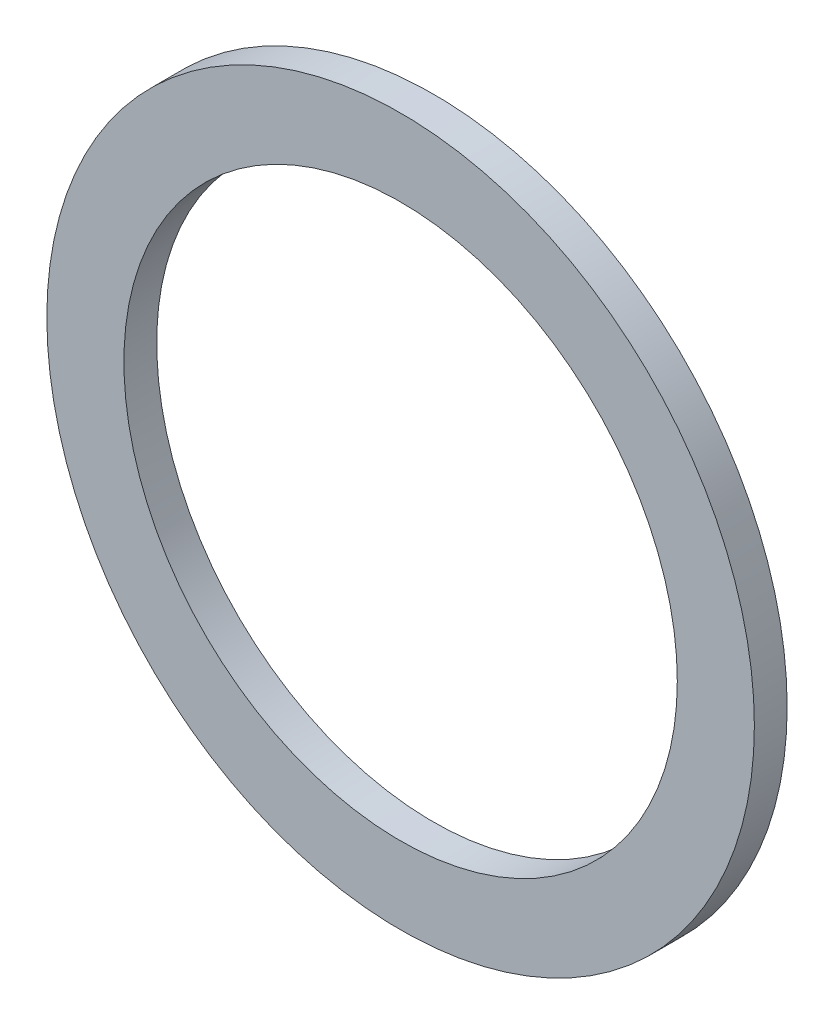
ISO-10303-21;
HEADER;
FILE_DESCRIPTION(('STEP AP214'),'2;1');
FILE_NAME('part.step','',(''),(''),'','','');
FILE_SCHEMA(('AUTOMOTIVE_DESIGN { 1 0 10303 214 1 1 1 1 }'));
ENDSEC;
DATA;
#1=APPLICATION_CONTEXT('core data for automotive mechanical design processes');
#2=APPLICATION_PROTOCOL_DEFINITION('international standard','automotive_design',2000,#1);
#3=PRODUCT_CONTEXT('',#1,'mechanical');
#4=PRODUCT('Part','Part','',(#3));
#5=PRODUCT_RELATED_PRODUCT_CATEGORY('part','',(#4));
#6=PRODUCT_DEFINITION_FORMATION('','',#4);
#7=PRODUCT_DEFINITION_CONTEXT('part definition',#1,'design');
#8=PRODUCT_DEFINITION('design','',#6,#7);
#9=PRODUCT_DEFINITION_SHAPE('','',#8);
#10=(LENGTH_UNIT() NAMED_UNIT(*) SI_UNIT(.MILLI.,.METRE.));
#11=(NAMED_UNIT(*) PLANE_ANGLE_UNIT() SI_UNIT($,.RADIAN.));
#12=(NAMED_UNIT(*) SI_UNIT($,.STERADIAN.) SOLID_ANGLE_UNIT());
#13=UNCERTAINTY_MEASURE_WITH_UNIT(LENGTH_MEASURE(1.E-05),#10,'distance_accuracy_value','');
#14=(GEOMETRIC_REPRESENTATION_CONTEXT(3) GLOBAL_UNCERTAINTY_ASSIGNED_CONTEXT((#13)) GLOBAL_UNIT_ASSIGNED_CONTEXT((#10,
#11,#12)) REPRESENTATION_CONTEXT('',''));
#15=CARTESIAN_POINT('',(0.,0.,0.));
#16=DIRECTION('',(0.,0.,1.));
#17=DIRECTION('',(1.,0.,0.));
#18=AXIS2_PLACEMENT_3D('',#15,#16,#17);
#19=CARTESIAN_POINT('',(0.,0.,1.016));
#20=DIRECTION('',(0.,0.,1.));
#21=DIRECTION('',(1.,0.,0.));
#22=AXIS2_PLACEMENT_3D('',#19,#20,#21);
#23=PLANE('',#22);
#24=CARTESIAN_POINT('',(0.,0.,1.016));
#25=DIRECTION('',(0.,0.,1.));
#26=DIRECTION('',(1.,0.,0.));
#27=AXIS2_PLACEMENT_3D('',#24,#25,#26);
#28=CIRCLE('',#27,10.9601);
#29=CARTESIAN_POINT('',(10.9601,0.,1.016));
#30=VERTEX_POINT('',#29);
#31=EDGE_CURVE('E11',#30,#30,#28,.T.);
#32=ORIENTED_EDGE('',*,*,#31,.T.);
#33=EDGE_LOOP('',(#32));
#34=FACE_BOUND('',#33,.T.);
#35=CARTESIAN_POINT('',(0.,0.,1.016));
#36=DIRECTION('',(0.,0.,1.));
#37=DIRECTION('',(1.,0.,0.));
#38=AXIS2_PLACEMENT_3D('',#35,#36,#37);
#39=CIRCLE('',#38,8.5725);
#40=CARTESIAN_POINT('',(8.5725,0.,1.016));
#41=VERTEX_POINT('',#40);
#42=EDGE_CURVE('E51',#41,#41,#39,.T.);
#43=ORIENTED_EDGE('',*,*,#42,.F.);
#44=EDGE_LOOP('',(#43));
#45=FACE_BOUND('',#44,.T.);
#46=ADVANCED_FACE('F40',(#34,#45),#23,.T.);
#47=CARTESIAN_POINT('',(0.,0.,0.));
#48=DIRECTION('',(0.,0.,1.));
#49=DIRECTION('',(1.,0.,0.));
#50=AXIS2_PLACEMENT_3D('',#47,#48,#49);
#51=PLANE('',#50);
#52=CARTESIAN_POINT('',(0.,0.,0.));
#53=DIRECTION('',(0.,0.,1.));
#54=DIRECTION('',(1.,0.,0.));
#55=AXIS2_PLACEMENT_3D('',#52,#53,#54);
#56=CIRCLE('',#55,10.9601);
#57=CARTESIAN_POINT('',(10.9601,0.,0.));
#58=VERTEX_POINT('',#57);
#59=EDGE_CURVE('E47',#58,#58,#56,.T.);
#60=ORIENTED_EDGE('',*,*,#59,.F.);
#61=EDGE_LOOP('',(#60));
#62=FACE_BOUND('',#61,.T.);
#63=CARTESIAN_POINT('',(0.,0.,0.));
#64=DIRECTION('',(0.,0.,1.));
#65=DIRECTION('',(1.,0.,0.));
#66=AXIS2_PLACEMENT_3D('',#63,#64,#65);
#67=CIRCLE('',#66,8.5725);
#68=CARTESIAN_POINT('',(8.5725,0.,0.));
#69=VERTEX_POINT('',#68);
#70=EDGE_CURVE('E55',#69,#69,#67,.T.);
#71=ORIENTED_EDGE('',*,*,#70,.T.);
#72=EDGE_LOOP('',(#71));
#73=FACE_BOUND('',#72,.T.);
#74=ADVANCED_FACE('F61',(#62,#73),#51,.F.);
#75=CARTESIAN_POINT('',(0.,0.,1.016));
#76=DIRECTION('',(0.,0.,-1.));
#77=DIRECTION('',(-1.,0.,0.));
#78=AXIS2_PLACEMENT_3D('',#75,#76,#77);
#79=CYLINDRICAL_SURFACE('',#78,10.9601);
#80=ORIENTED_EDGE('',*,*,#31,.F.);
#81=EDGE_LOOP('',(#80));
#82=FACE_BOUND('',#81,.T.);
#83=ORIENTED_EDGE('',*,*,#59,.T.);
#84=EDGE_LOOP('',(#83));
#85=FACE_BOUND('',#84,.T.);
#86=ADVANCED_FACE('F42',(#82,#85),#79,.T.);
#87=CARTESIAN_POINT('',(0.,0.,1.016));
#88=DIRECTION('',(0.,0.,-1.));
#89=DIRECTION('',(-1.,0.,0.));
#90=AXIS2_PLACEMENT_3D('',#87,#88,#89);
#91=CYLINDRICAL_SURFACE('',#90,8.5725);
#92=ORIENTED_EDGE('',*,*,#42,.T.);
#93=EDGE_LOOP('',(#92));
#94=FACE_BOUND('',#93,.T.);
#95=ORIENTED_EDGE('',*,*,#70,.F.);
#96=EDGE_LOOP('',(#95));
#97=FACE_BOUND('',#96,.T.);
#98=ADVANCED_FACE('F63',(#94,#97),#91,.F.);
#99=CLOSED_SHELL('',(#46,#74,#86,#98));
#100=MANIFOLD_SOLID_BREP('B2',#99);
#101=ADVANCED_BREP_SHAPE_REPRESENTATION('',(#18,#100),#14);
#102=SHAPE_DEFINITION_REPRESENTATION(#9,#101);
ENDSEC;
END-ISO-10303-21;
